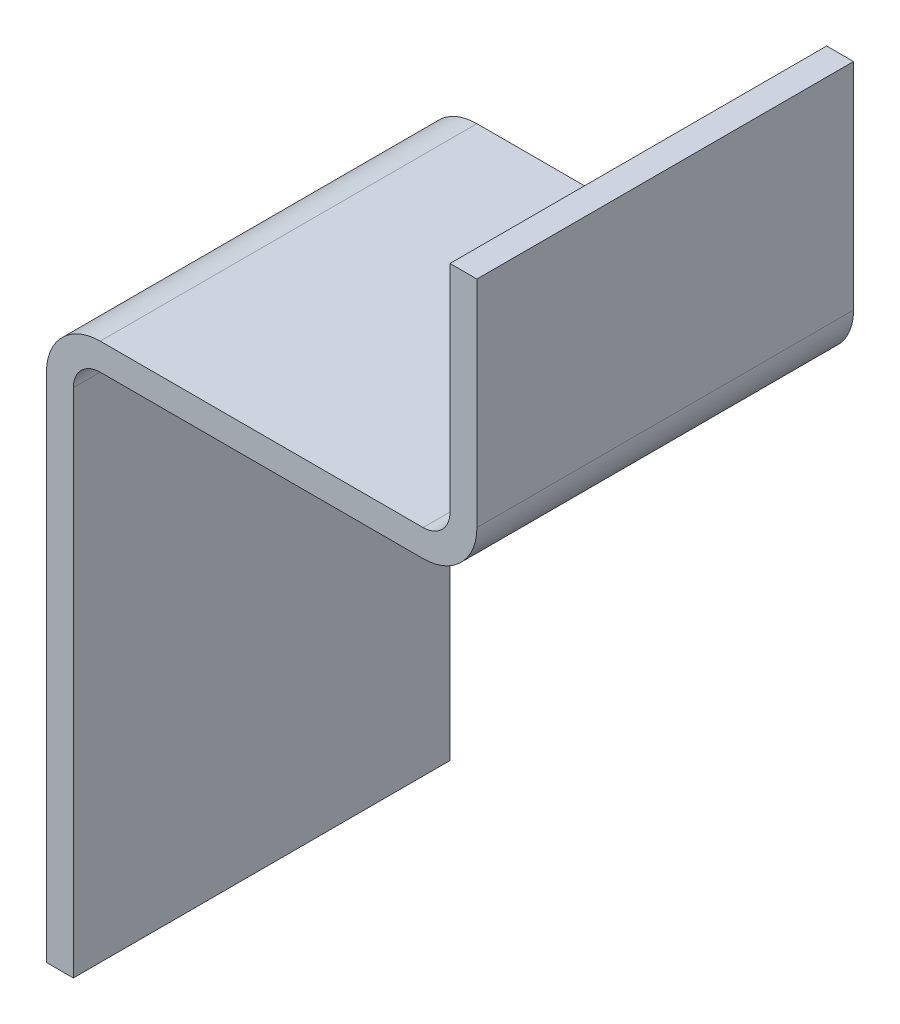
from build123d import *

# Parameters (mm, degrees)
LINEAR_AUSTRAGEN1_DEPTH = 70


with BuildPart() as part:
    # Skizze1 → Linear austragen1 (new body)
    with BuildSketch(Plane.XY):
        with BuildLine():
            Line((75, 110), (75, 150))
            Line((75, 150), (70, 150))
            Line((70, 150), (70, 110))
            ThreePointArc((70, 110), (68.535533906, 106.464466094), (65, 105))
            Line((65, 105), (5, 105))
            ThreePointArc((5, 105), (-2.071067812, 102.071067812), (-5, 95))
            Line((-5, 95), (-5, 0))
            Line((-5, 0), (0, 0))
            Line((0, 0), (0, 95))
            ThreePointArc((0, 95), (1.464466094, 98.535533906), (5, 100))
            Line((5, 100), (65, 100))
            ThreePointArc((65, 100), (72.071067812, 102.928932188), (75, 110))
        make_face()
    extrude(amount=LINEAR_AUSTRAGEN1_DEPTH)


solid = part.part
